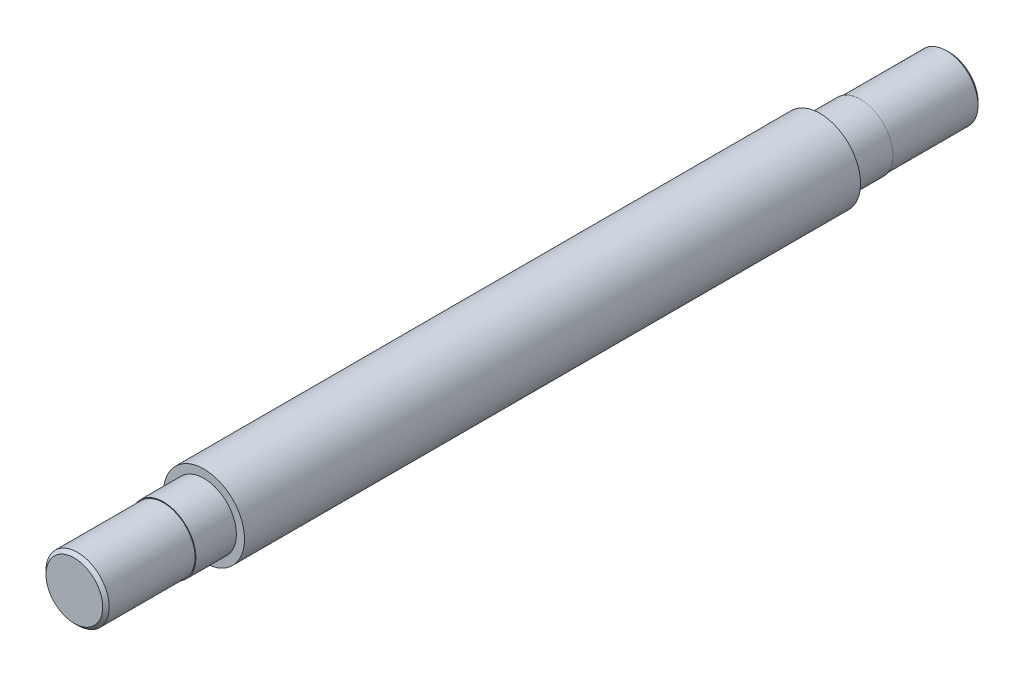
ISO-10303-21;
HEADER;
FILE_DESCRIPTION(('STEP AP214'),'2;1');
FILE_NAME('part.step','',(''),(''),'','','');
FILE_SCHEMA(('AUTOMOTIVE_DESIGN { 1 0 10303 214 1 1 1 1 }'));
ENDSEC;
DATA;
#1=APPLICATION_CONTEXT('core data for automotive mechanical design processes');
#2=APPLICATION_PROTOCOL_DEFINITION('international standard','automotive_design',2000,#1);
#3=PRODUCT_CONTEXT('',#1,'mechanical');
#4=PRODUCT('Part','Part','',(#3));
#5=PRODUCT_RELATED_PRODUCT_CATEGORY('part','',(#4));
#6=PRODUCT_DEFINITION_FORMATION('','',#4);
#7=PRODUCT_DEFINITION_CONTEXT('part definition',#1,'design');
#8=PRODUCT_DEFINITION('design','',#6,#7);
#9=PRODUCT_DEFINITION_SHAPE('','',#8);
#10=(LENGTH_UNIT() NAMED_UNIT(*) SI_UNIT(.MILLI.,.METRE.));
#11=(NAMED_UNIT(*) PLANE_ANGLE_UNIT() SI_UNIT($,.RADIAN.));
#12=(NAMED_UNIT(*) SI_UNIT($,.STERADIAN.) SOLID_ANGLE_UNIT());
#13=UNCERTAINTY_MEASURE_WITH_UNIT(LENGTH_MEASURE(1.E-05),#10,'distance_accuracy_value','');
#14=(GEOMETRIC_REPRESENTATION_CONTEXT(3) GLOBAL_UNCERTAINTY_ASSIGNED_CONTEXT((#13)) GLOBAL_UNIT_ASSIGNED_CONTEXT((#10,
#11,#12)) REPRESENTATION_CONTEXT('',''));
#15=CARTESIAN_POINT('',(0.,0.,0.));
#16=DIRECTION('',(0.,0.,1.));
#17=DIRECTION('',(1.,0.,0.));
#18=AXIS2_PLACEMENT_3D('',#15,#16,#17);
#19=CARTESIAN_POINT('',(0.,0.,380.));
#20=DIRECTION('',(0.,0.,-1.));
#21=DIRECTION('',(-1.,0.,0.));
#22=AXIS2_PLACEMENT_3D('',#19,#20,#21);
#23=CYLINDRICAL_SURFACE('',#22,25.);
#24=CARTESIAN_POINT('',(0.,0.,380.));
#25=DIRECTION('',(0.,0.,1.));
#26=DIRECTION('',(1.,0.,0.));
#27=AXIS2_PLACEMENT_3D('',#24,#25,#26);
#28=CIRCLE('',#27,25.);
#29=CARTESIAN_POINT('',(25.,0.,380.));
#30=VERTEX_POINT('',#29);
#31=EDGE_CURVE('E59',#30,#30,#28,.T.);
#32=ORIENTED_EDGE('',*,*,#31,.F.);
#33=EDGE_LOOP('',(#32));
#34=FACE_BOUND('',#33,.T.);
#35=CARTESIAN_POINT('',(0.,0.,0.));
#36=DIRECTION('',(0.,0.,1.));
#37=DIRECTION('',(1.,0.,0.));
#38=AXIS2_PLACEMENT_3D('',#35,#36,#37);
#39=CIRCLE('',#38,25.);
#40=CARTESIAN_POINT('',(25.,0.,0.));
#41=VERTEX_POINT('',#40);
#42=EDGE_CURVE('E60',#41,#41,#39,.T.);
#43=ORIENTED_EDGE('',*,*,#42,.T.);
#44=EDGE_LOOP('',(#43));
#45=FACE_BOUND('',#44,.T.);
#46=ADVANCED_FACE('F36',(#34,#45),#23,.T.);
#47=CARTESIAN_POINT('',(0.,0.,380.));
#48=DIRECTION('',(0.,0.,1.));
#49=DIRECTION('',(1.,0.,0.));
#50=AXIS2_PLACEMENT_3D('',#47,#48,#49);
#51=PLANE('',#50);
#52=CARTESIAN_POINT('',(0.,0.,380.));
#53=DIRECTION('',(0.,0.,1.));
#54=DIRECTION('',(1.,0.,0.));
#55=AXIS2_PLACEMENT_3D('',#52,#53,#54);
#56=CIRCLE('',#55,20.);
#57=CARTESIAN_POINT('',(20.,0.,380.));
#58=VERTEX_POINT('',#57);
#59=EDGE_CURVE('E66',#58,#58,#56,.T.);
#60=ORIENTED_EDGE('',*,*,#59,.F.);
#61=EDGE_LOOP('',(#60));
#62=FACE_BOUND('',#61,.T.);
#63=ORIENTED_EDGE('',*,*,#31,.T.);
#64=EDGE_LOOP('',(#63));
#65=FACE_BOUND('',#64,.T.);
#66=ADVANCED_FACE('F101',(#62,#65),#51,.T.);
#67=CARTESIAN_POINT('',(0.,0.,0.));
#68=DIRECTION('',(0.,0.,1.));
#69=DIRECTION('',(1.,0.,0.));
#70=AXIS2_PLACEMENT_3D('',#67,#68,#69);
#71=PLANE('',#70);
#72=CARTESIAN_POINT('',(0.,0.,0.));
#73=DIRECTION('',(0.,0.,1.));
#74=DIRECTION('',(1.,0.,0.));
#75=AXIS2_PLACEMENT_3D('',#72,#73,#74);
#76=CIRCLE('',#75,20.);
#77=CARTESIAN_POINT('',(20.,0.,0.));
#78=VERTEX_POINT('',#77);
#79=EDGE_CURVE('E56',#78,#78,#76,.F.);
#80=ORIENTED_EDGE('',*,*,#79,.F.);
#81=EDGE_LOOP('',(#80));
#82=FACE_BOUND('',#81,.T.);
#83=ORIENTED_EDGE('',*,*,#42,.F.);
#84=EDGE_LOOP('',(#83));
#85=FACE_BOUND('',#84,.T.);
#86=ADVANCED_FACE('F97',(#82,#85),#71,.F.);
#87=CARTESIAN_POINT('',(0.,0.,405.));
#88=DIRECTION('',(0.,0.,-1.));
#89=DIRECTION('',(-1.,0.,0.));
#90=AXIS2_PLACEMENT_3D('',#87,#88,#89);
#91=CYLINDRICAL_SURFACE('',#90,20.);
#92=CARTESIAN_POINT('',(0.,0.,405.));
#93=DIRECTION('',(0.,0.,1.));
#94=DIRECTION('',(1.,0.,0.));
#95=AXIS2_PLACEMENT_3D('',#92,#93,#94);
#96=CIRCLE('',#95,20.);
#97=CARTESIAN_POINT('',(20.,0.,405.));
#98=VERTEX_POINT('',#97);
#99=EDGE_CURVE('E63',#98,#98,#96,.T.);
#100=ORIENTED_EDGE('',*,*,#99,.F.);
#101=EDGE_LOOP('',(#100));
#102=FACE_BOUND('',#101,.T.);
#103=ORIENTED_EDGE('',*,*,#59,.T.);
#104=EDGE_LOOP('',(#103));
#105=FACE_BOUND('',#104,.T.);
#106=ADVANCED_FACE('F100',(#102,#105),#91,.T.);
#107=CARTESIAN_POINT('',(0.,0.,405.));
#108=DIRECTION('',(0.,0.,1.));
#109=DIRECTION('',(1.,0.,0.));
#110=AXIS2_PLACEMENT_3D('',#107,#108,#109);
#111=PLANE('',#110);
#112=CARTESIAN_POINT('',(0.,0.,405.));
#113=DIRECTION('',(0.,0.,1.));
#114=DIRECTION('',(1.,0.,0.));
#115=AXIS2_PLACEMENT_3D('',#112,#113,#114);
#116=CIRCLE('',#115,19.5);
#117=CARTESIAN_POINT('',(19.5,0.,405.));
#118=VERTEX_POINT('',#117);
#119=EDGE_CURVE('E74',#118,#118,#116,.T.);
#120=ORIENTED_EDGE('',*,*,#119,.F.);
#121=EDGE_LOOP('',(#120));
#122=FACE_BOUND('',#121,.T.);
#123=ORIENTED_EDGE('',*,*,#99,.T.);
#124=EDGE_LOOP('',(#123));
#125=FACE_BOUND('',#124,.T.);
#126=ADVANCED_FACE('F93',(#122,#125),#111,.T.);
#127=CARTESIAN_POINT('',(0.,0.,-25.));
#128=DIRECTION('',(0.,0.,1.));
#129=DIRECTION('',(1.,0.,0.));
#130=AXIS2_PLACEMENT_3D('',#127,#128,#129);
#131=CYLINDRICAL_SURFACE('',#130,20.);
#132=CARTESIAN_POINT('',(0.,0.,-25.));
#133=DIRECTION('',(0.,0.,-1.));
#134=DIRECTION('',(-1.,0.,0.));
#135=AXIS2_PLACEMENT_3D('',#132,#133,#134);
#136=CIRCLE('',#135,20.);
#137=CARTESIAN_POINT('',(-20.,0.,-25.));
#138=VERTEX_POINT('',#137);
#139=EDGE_CURVE('E69',#138,#138,#136,.T.);
#140=ORIENTED_EDGE('',*,*,#139,.F.);
#141=EDGE_LOOP('',(#140));
#142=FACE_BOUND('',#141,.T.);
#143=ORIENTED_EDGE('',*,*,#79,.T.);
#144=EDGE_LOOP('',(#143));
#145=FACE_BOUND('',#144,.T.);
#146=ADVANCED_FACE('F87',(#142,#145),#131,.T.);
#147=CARTESIAN_POINT('',(0.,0.,-25.));
#148=DIRECTION('',(0.,0.,-1.));
#149=DIRECTION('',(-1.,0.,0.));
#150=AXIS2_PLACEMENT_3D('',#147,#148,#149);
#151=PLANE('',#150);
#152=CARTESIAN_POINT('',(0.,0.,-25.));
#153=DIRECTION('',(0.,0.,-1.));
#154=DIRECTION('',(-1.,0.,0.));
#155=AXIS2_PLACEMENT_3D('',#152,#153,#154);
#156=CIRCLE('',#155,19.5);
#157=CARTESIAN_POINT('',(-19.5,0.,-25.));
#158=VERTEX_POINT('',#157);
#159=EDGE_CURVE('E77',#158,#158,#156,.T.);
#160=ORIENTED_EDGE('',*,*,#159,.F.);
#161=EDGE_LOOP('',(#160));
#162=FACE_BOUND('',#161,.T.);
#163=ORIENTED_EDGE('',*,*,#139,.T.);
#164=EDGE_LOOP('',(#163));
#165=FACE_BOUND('',#164,.T.);
#166=ADVANCED_FACE('F83',(#162,#165),#151,.T.);
#167=CARTESIAN_POINT('',(0.,0.,460.));
#168=DIRECTION('',(0.,0.,-1.));
#169=DIRECTION('',(-1.,0.,0.));
#170=AXIS2_PLACEMENT_3D('',#167,#168,#169);
#171=CYLINDRICAL_SURFACE('',#170,19.5);
#172=CARTESIAN_POINT('',(0.,0.,458.));
#173=DIRECTION('',(0.,0.,1.));
#174=DIRECTION('',(1.,0.,0.));
#175=AXIS2_PLACEMENT_3D('',#172,#173,#174);
#176=CIRCLE('',#175,19.5);
#177=CARTESIAN_POINT('',(19.5,0.,458.));
#178=VERTEX_POINT('',#177);
#179=EDGE_CURVE('E10',#178,#178,#176,.F.);
#180=ORIENTED_EDGE('',*,*,#179,.T.);
#181=EDGE_LOOP('',(#180));
#182=FACE_BOUND('',#181,.T.);
#183=ORIENTED_EDGE('',*,*,#119,.T.);
#184=EDGE_LOOP('',(#183));
#185=FACE_BOUND('',#184,.T.);
#186=ADVANCED_FACE('F86',(#182,#185),#171,.T.);
#187=CARTESIAN_POINT('',(0.,0.,460.));
#188=DIRECTION('',(0.,0.,1.));
#189=DIRECTION('',(1.,0.,0.));
#190=AXIS2_PLACEMENT_3D('',#187,#188,#189);
#191=PLANE('',#190);
#192=CARTESIAN_POINT('',(0.,0.,460.));
#193=DIRECTION('',(0.,0.,1.));
#194=DIRECTION('',(1.,0.,0.));
#195=AXIS2_PLACEMENT_3D('',#192,#193,#194);
#196=CIRCLE('',#195,17.5000000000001);
#197=CARTESIAN_POINT('',(17.5000000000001,0.,460.));
#198=VERTEX_POINT('',#197);
#199=EDGE_CURVE('E43',#198,#198,#196,.T.);
#200=ORIENTED_EDGE('',*,*,#199,.T.);
#201=EDGE_LOOP('',(#200));
#202=FACE_BOUND('',#201,.T.);
#203=ADVANCED_FACE('F130',(#202),#191,.T.);
#204=CARTESIAN_POINT('',(0.,0.,-80.));
#205=DIRECTION('',(0.,0.,1.));
#206=DIRECTION('',(1.,0.,0.));
#207=AXIS2_PLACEMENT_3D('',#204,#205,#206);
#208=CYLINDRICAL_SURFACE('',#207,19.5);
#209=CARTESIAN_POINT('',(0.,0.,-78.0000000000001));
#210=DIRECTION('',(0.,0.,-1.));
#211=DIRECTION('',(-1.,0.,0.));
#212=AXIS2_PLACEMENT_3D('',#209,#210,#211);
#213=CIRCLE('',#212,19.5);
#214=CARTESIAN_POINT('',(-19.5,0.,-78.0000000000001));
#215=VERTEX_POINT('',#214);
#216=EDGE_CURVE('E47',#215,#215,#213,.F.);
#217=ORIENTED_EDGE('',*,*,#216,.T.);
#218=EDGE_LOOP('',(#217));
#219=FACE_BOUND('',#218,.T.);
#220=ORIENTED_EDGE('',*,*,#159,.T.);
#221=EDGE_LOOP('',(#220));
#222=FACE_BOUND('',#221,.T.);
#223=ADVANCED_FACE('F81',(#219,#222),#208,.T.);
#224=CARTESIAN_POINT('',(0.,0.,-80.));
#225=DIRECTION('',(0.,0.,-1.));
#226=DIRECTION('',(-1.,0.,0.));
#227=AXIS2_PLACEMENT_3D('',#224,#225,#226);
#228=PLANE('',#227);
#229=CARTESIAN_POINT('',(0.,0.,-80.));
#230=DIRECTION('',(0.,0.,-1.));
#231=DIRECTION('',(-1.,0.,0.));
#232=AXIS2_PLACEMENT_3D('',#229,#230,#231);
#233=CIRCLE('',#232,17.5000000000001);
#234=CARTESIAN_POINT('',(-17.5000000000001,0.,-80.));
#235=VERTEX_POINT('',#234);
#236=EDGE_CURVE('E51',#235,#235,#233,.T.);
#237=ORIENTED_EDGE('',*,*,#236,.T.);
#238=EDGE_LOOP('',(#237));
#239=FACE_BOUND('',#238,.T.);
#240=ADVANCED_FACE('F116',(#239),#228,.T.);
#241=CARTESIAN_POINT('',(0.,0.,-80.));
#242=DIRECTION('',(0.,0.,1.));
#243=DIRECTION('',(1.,0.,0.));
#244=AXIS2_PLACEMENT_3D('',#241,#242,#243);
#245=CONICAL_SURFACE('',#244,17.5000000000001,0.785398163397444);
#246=ORIENTED_EDGE('',*,*,#216,.F.);
#247=EDGE_LOOP('',(#246));
#248=FACE_BOUND('',#247,.T.);
#249=ORIENTED_EDGE('',*,*,#236,.F.);
#250=EDGE_LOOP('',(#249));
#251=FACE_BOUND('',#250,.T.);
#252=ADVANCED_FACE('F114',(#248,#251),#245,.T.);
#253=CARTESIAN_POINT('',(0.,0.,460.));
#254=DIRECTION('',(0.,0.,-1.));
#255=DIRECTION('',(-1.,0.,0.));
#256=AXIS2_PLACEMENT_3D('',#253,#254,#255);
#257=CONICAL_SURFACE('',#256,17.5000000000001,0.785398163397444);
#258=ORIENTED_EDGE('',*,*,#179,.F.);
#259=EDGE_LOOP('',(#258));
#260=FACE_BOUND('',#259,.T.);
#261=ORIENTED_EDGE('',*,*,#199,.F.);
#262=EDGE_LOOP('',(#261));
#263=FACE_BOUND('',#262,.T.);
#264=ADVANCED_FACE('F38',(#260,#263),#257,.T.);
#265=CLOSED_SHELL('',(#46,#66,#86,#106,#126,#146,#166,#186,#203,#223,#240,#252,#264));
#266=MANIFOLD_SOLID_BREP('B2',#265);
#267=ADVANCED_BREP_SHAPE_REPRESENTATION('',(#18,#266),#14);
#268=SHAPE_DEFINITION_REPRESENTATION(#9,#267);
ENDSEC;
END-ISO-10303-21;
